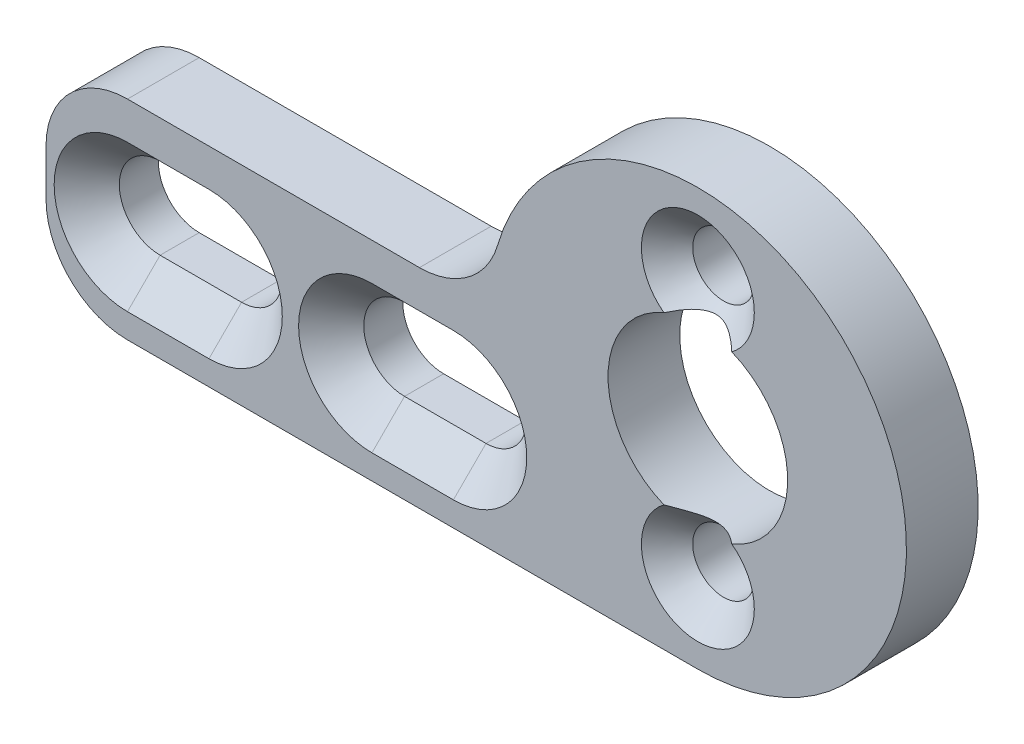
from build123d import *

# Parameters (mm, degrees)
SKETCH1_R                                       = 3.5
EXTRUDE1_DEPTH                                  = 2.794
CSK_FOR_M2_FLAT_HEAD_MACHINE_SCREW1_D           = 2.4
CSK_FOR_M2_FLAT_HEAD_MACHINE_SCREW1_CSINK_D     = 4.4
CSK_FOR_M2_FLAT_HEAD_MACHINE_SCREW1_CSINK_ANGLE = 90
CUT_EXTRUDE1_DEPTH                              = 27.814750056
LPATTERN1_COUNT                                 = 2
LPATTERN1_PITCH                                 = 9.525
CHAMFER1_SIZE                                   = 1.27
FILLET1_R                                       = 3.175


with BuildPart() as part:
    # Sketch1 → Extrude1 (new body)
    with BuildSketch(Plane.XY):
        with BuildLine():
            Line((0, -8.128), (-25.4, -8.128))
            Line((-25.4, -8.128), (-25.4, 0))
            Line((-25.4, 0), (-8.128, 0))
            ThreePointArc((-8.128, 0), (5.747363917, 5.747363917), (0, -8.128))
        make_face()
        Circle(SKETCH1_R, mode=Mode.SUBTRACT)
    extrude(amount=EXTRUDE1_DEPTH)

    # CSK for M2 Flat Head Machine Screw1 (through all)
    with Locations(Plane.XY.offset(2.794)):
        with Locations((0, 5), (0, -5)):
            CounterSinkHole(CSK_FOR_M2_FLAT_HEAD_MACHINE_SCREW1_D / 2, CSK_FOR_M2_FLAT_HEAD_MACHINE_SCREW1_CSINK_D / 2, counter_sink_angle=CSK_FOR_M2_FLAT_HEAD_MACHINE_SCREW1_CSINK_ANGLE)

    # Sketch4 → Cut-Extrude1 (cut, through all)
    with BuildSketch(Plane.XY.offset(2.794)):
        with BuildLine():
            Line((-22.225, -2.7305), (-19.05, -2.7305))
            ThreePointArc((-19.05, -2.7305), (-17.4625, -4.318), (-19.05, -5.9055))
            Line((-19.05, -5.9055), (-22.225, -5.9055))
            ThreePointArc((-22.225, -5.9055), (-23.8125, -4.318), (-22.225, -2.7305))
        make_face()
    cut_extrude1 = extrude(amount=-CUT_EXTRUDE1_DEPTH, mode=Mode.SUBTRACT)

    # LPattern1: Cut-Extrude1 ×2
    with Locations(*[(i * LPATTERN1_PITCH, 0, 0) for i in range(1, LPATTERN1_COUNT)]):
        add(cut_extrude1, mode=Mode.SUBTRACT)

    # Chamfer1
    chamfer1_edges = [part.edges().sort_by_distance(p)[0] for p in [
        (-23.8125, -4.318, 2.794),
        (-20.6375, -5.9055, 2.794),
        (-17.4625, -4.318, 2.794),
        (-20.6375, -2.7305, 2.794),
        (-14.2875, -4.318, 2.794),
        (-11.1125, -5.9055, 2.794),
        (-7.9375, -4.318, 2.794),
        (-11.1125, -2.7305, 2.794),
    ]]
    chamfer(chamfer1_edges, length=CHAMFER1_SIZE)

    # Fillet1
    fillet1_edges = [part.edges().sort_by_distance(p)[0] for p in [
        (-25.4, -8.128, 1.397),
        (-25.4, 0, 1.397),
        (-8.128, 0, 1.397),
    ]]
    fillet(fillet1_edges, radius=FILLET1_R)


solid = part.part
